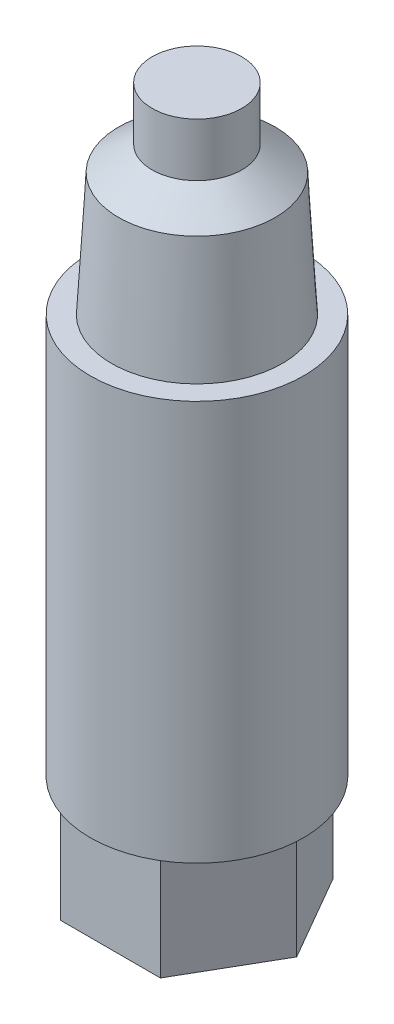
from build123d import *

# Parameters (mm, degrees)
EXTRUDE1_DEPTH = 12.7
SKETCH2_R      = 12.7
EXTRUDE2_DEPTH = 47.625


with BuildPart() as part:
    # Sketch1 → Extrude1 (new body)
    with BuildSketch(Plane(origin=(0, 0, 0), x_dir=(1, 0, 0), z_dir=(0, 1, 0))):
        Polygon((-5.939202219, -10.287), (5.939202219, -10.287), (11.878404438, 0), (5.939202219, 10.287), (-5.939202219, 10.287), (-11.878404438, 0), align=None)
    extrude(amount=EXTRUDE1_DEPTH)

    # Sketch2 → Extrude2 (add)
    with BuildSketch(Plane(origin=(0, 12.7, 0), x_dir=(1, 0, 0), z_dir=(0, 1, 0))):
        with Locations(Location((0, 0, 0), (0, 0, 270))):
            Circle(SKETCH2_R)
    extrude(amount=EXTRUDE2_DEPTH)

    # Sketch3 → Revolve1 (revolve)
    with BuildSketch(Plane.XY, mode=Mode.PRIVATE) as revolve1_sk:
        Polygon((-10.16, 60.325), (-9.3345, 74.974406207), (-5.334, 77.873498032), (-5.334, 84.223498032), (0, 84.223498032), (0, 60.325), align=None)
    revolve(revolve1_sk.sketch.rotate(Axis((0, 60.325, 0), (0, 1, 0)), 270), axis=Axis((0, 60.325, 0), (0, 1, 0)))


solid = part.part
